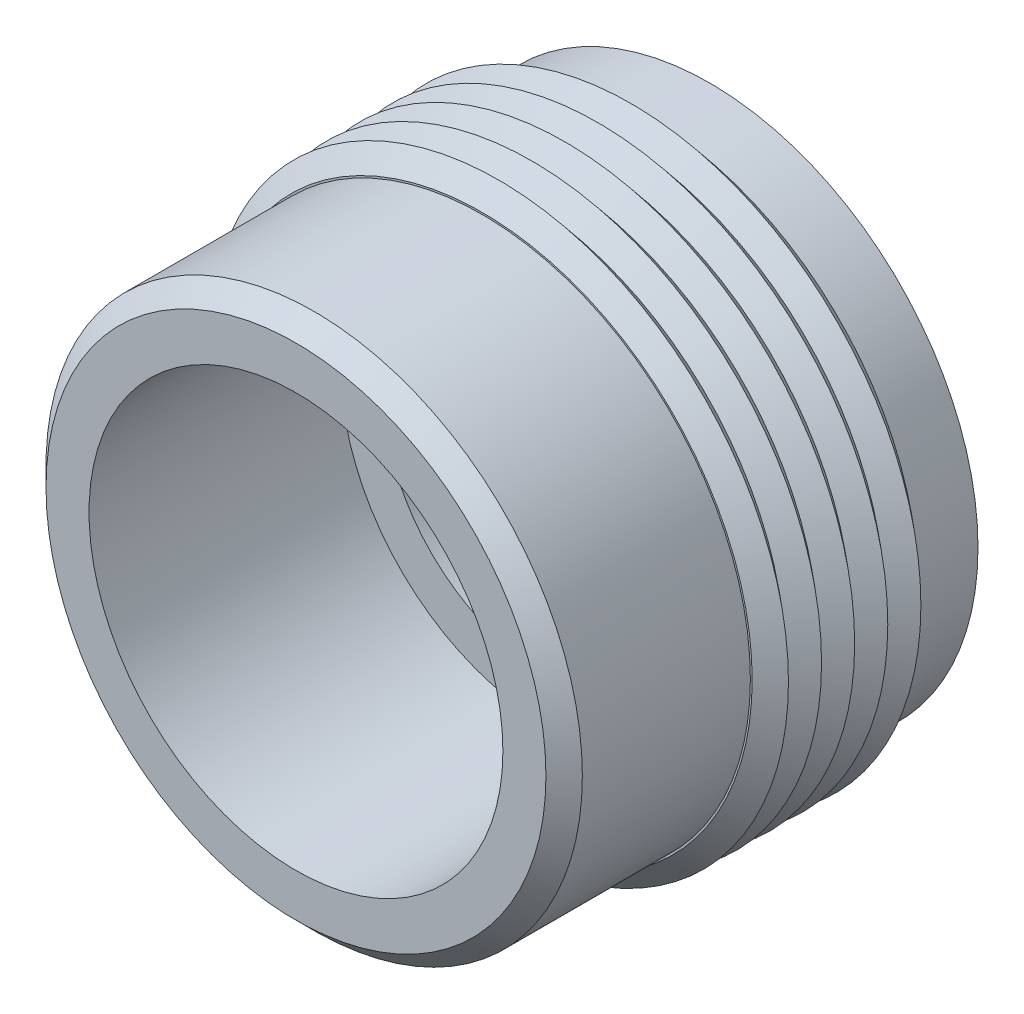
from build123d import *

# Parameters (mm, degrees)
SKETCH4_W      = 9.652
SKETCH4_H      = 7.9375
SKETCH5_R      = 6.2992
EXTRUDE1_DEPTH = 19.442787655


with BuildPart() as part:
    # Sketch1 → Revolve2 (revolve)
    with BuildSketch(Plane(origin=(0, 0, 0), x_dir=(0, 0, -1), z_dir=(1, 0, 0)), mode=Mode.PRIVATE) as revolve2_sk:
        Polygon((-2.38125, 10.287), (0, 10.287), (0, 0), (-15.875, 0), (-15.875, 10.287), (-8.73125, 10.287), (-8.73125, 11.1125), (-2.38125, 11.1125), align=None)
    revolve(revolve2_sk.sketch.rotate(Axis((0, 0, 0), (0, 0, -1)), 90), axis=Axis((0, 0, 0), (0, 0, -1)))

    # Sketch4 → Cut-Revolve4 (revolve, cut)
    with BuildSketch(Plane(origin=(0, 0, 0), x_dir=(0, 0, -1), z_dir=(1, 0, 0)), mode=Mode.PRIVATE) as cut_revolve4_sk:
        with Locations((-11.049, 3.96875)):
            Rectangle(SKETCH4_W, SKETCH4_H)
    revolve(cut_revolve4_sk.sketch.rotate(Axis((0, 0, 0), (0, 0, -1)), 90), axis=Axis((0, 0, 0), (0, 0, -1)), mode=Mode.SUBTRACT)

    # Sketch5 → Extrude1 (cut, through all)
    with BuildSketch(Plane.XY.offset(6.223)):
        Circle(SKETCH5_R)
    extrude(amount=-EXTRUDE1_DEPTH, mode=Mode.SUBTRACT)

    # Sketch6 → 7_8-20 UNEF-2A (revolve, cut)
    with BuildSketch(Plane(origin=(0, 0, 0), x_dir=(1, 0, 0), z_dir=(0, 1, 0))):
        Polygon((10.35685, -8.73125), (11.1125, -8.09625), (10.35685, -7.46125), (11.1125, -6.82625), (10.35685, -6.19125), (11.1125, -5.55625), (10.35685, -4.92125), (11.1125, -4.28625), (10.35685, -3.65125), (11.1125, -3.01625), (10.35685, -2.38125), (10.35685, 4.420098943), (11.957702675, 4.420098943), (11.957702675, -8.878181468), (10.913640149, -8.878181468), align=None)
    revolve(axis=Axis((0, 0, 0), (0, 0, -1)), mode=Mode.SUBTRACT)

    # Sketch7 → Cut-Revolve5 (revolve, cut)
    with BuildSketch(Plane(origin=(0, 0, 0), x_dir=(0, 0, -1), z_dir=(1, 0, 0)), mode=Mode.PRIVATE) as cut_revolve5_sk:
        Polygon((-15.875, 9.5885), (-15.1765, 10.287), (-15.875, 10.287), align=None)
    revolve(cut_revolve5_sk.sketch.rotate(Axis((0, 0, 0), (0, 0, -1)), 90), axis=Axis((0, 0, 0), (0, 0, -1)), mode=Mode.SUBTRACT)


solid = part.part
